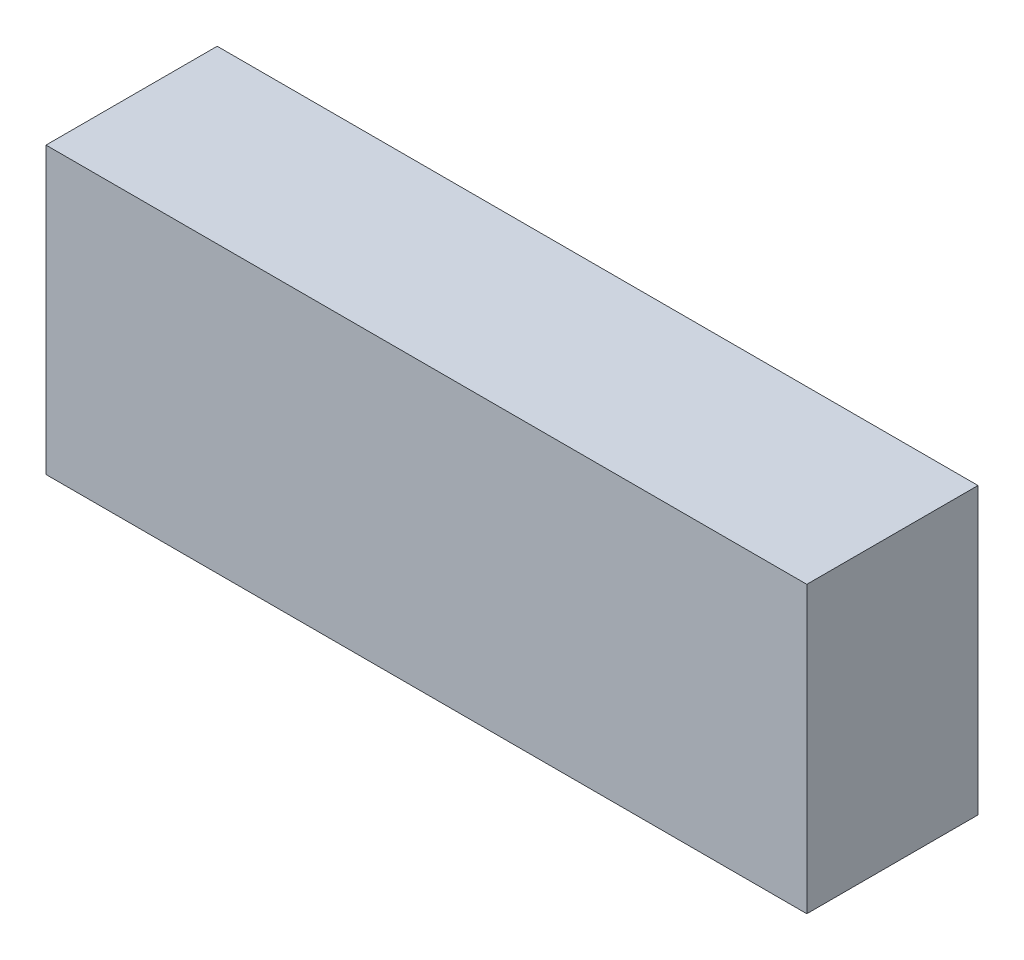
from build123d import *

# Parameters (mm, degrees)
SKETCH1_W           = 800
SKETCH1_H           = 300
BOSS_EXTRUDE1_DEPTH = 180


with BuildPart() as part:
    # Sketch1 → Boss-Extrude1 (new body)
    with BuildSketch(Plane.XY):
        with Locations((503.757714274, -258.745850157)):
            Rectangle(SKETCH1_W, SKETCH1_H)
    extrude(amount=BOSS_EXTRUDE1_DEPTH)


solid = part.part
